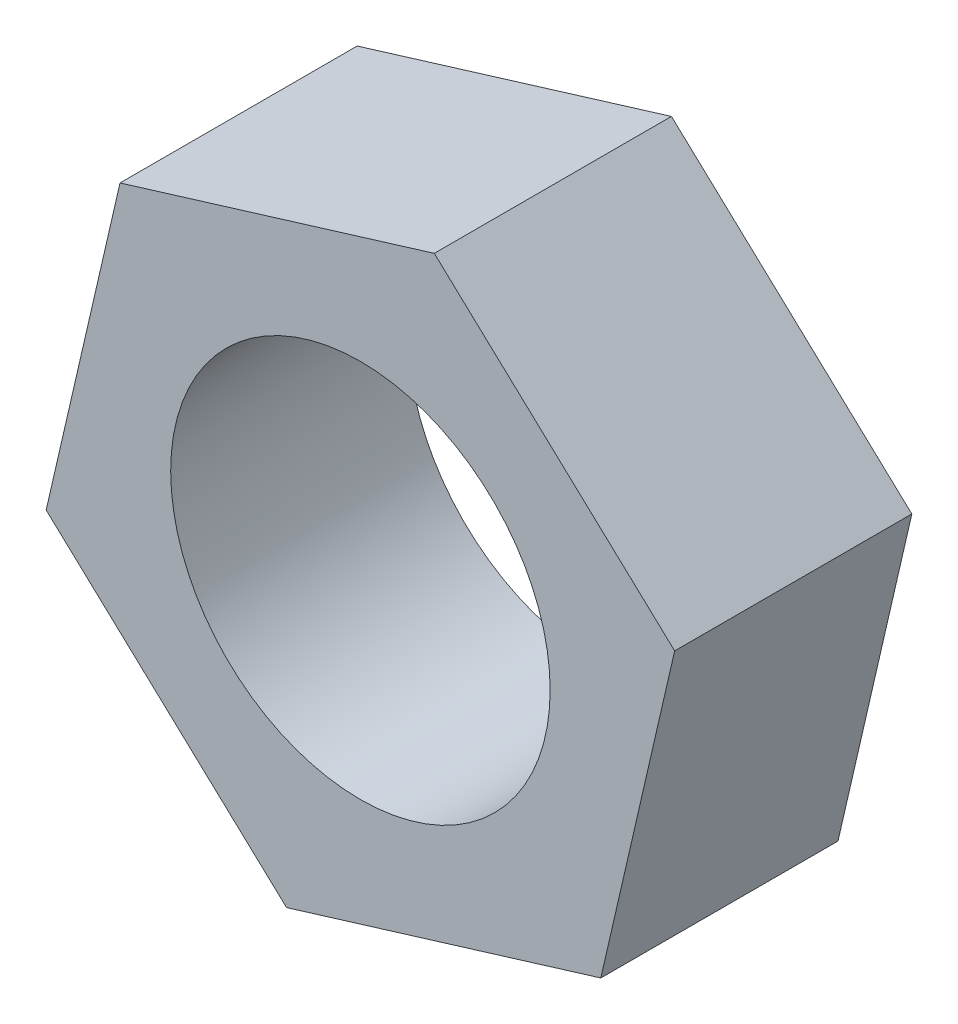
from build123d import *

# Parameters (mm, degrees)
SKETCH1_R           = 5.08
BOSS_EXTRUDE1_DEPTH = 6.35


with BuildPart() as part:
    # Sketch1 → Boss-Extrude1 (new body)
    with BuildSketch(Plane.XY):
        Polygon((6.436384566, -5.999346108), (8.413778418, 2.574399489), (1.977393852, 8.573745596), (-6.436384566, 5.999346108), (-8.413778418, -2.574399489), (-1.977393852, -8.573745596), align=None)
        Circle(SKETCH1_R, mode=Mode.SUBTRACT)
    extrude(amount=BOSS_EXTRUDE1_DEPTH)


solid = part.part
